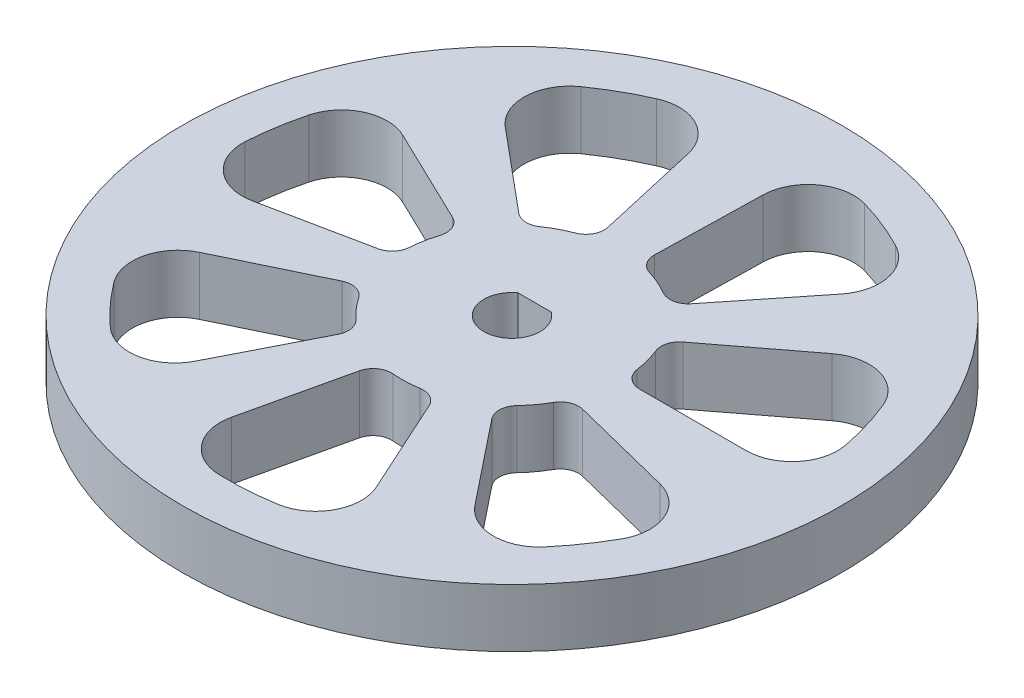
from build123d import *

# Parameters (mm, degrees)
SKETCH1_R      = 36
EXTRUDE1_DEPTH = 6.35


with BuildPart() as part:
    # Sketch1 → Extrude1 (new body)
    with BuildSketch(Plane(origin=(0, 0, 0), x_dir=(1, 0, 0), z_dir=(0, 1, 0))):
        with Locations(Location((0, 0, 0), (0, 0, 270))):
            Circle(SKETCH1_R)
        with BuildLine():
            Line((8.683422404, -10.88866729), (15.952628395, -20.003963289))
            ThreePointArc((15.952628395, -20.003963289), (19.783257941, -21.885897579), (23.671104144, -20.12520133))
            ThreePointArc((23.671104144, -20.12520133), (25.527775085, -17.710945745), (27.139153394, -15.12650829))
            ThreePointArc((27.139153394, -15.12650829), (27.361274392, -10.708283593), (23.990693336, -7.84310811))
            Line((23.990693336, -7.84310811), (12.721300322, -5.010243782))
            ThreePointArc((12.721300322, -5.010243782), (11.447614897, -5.110865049), (10.494737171, -5.961995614))
            ThreePointArc((10.494737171, -5.961995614), (9.711495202, -7.16740964), (8.790498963, -8.271156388))
            ThreePointArc((8.790498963, -8.271156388), (8.248756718, -9.559940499), (8.683422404, -10.88866729))
        make_face(mode=Mode.SUBTRACT)
        with BuildLine():
            Line((13.927128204, 0), (25.586029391, 0))
            ThreePointArc((25.586029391, 0), (29.445743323, 1.821539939), (30.493208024, 5.958956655))
            ThreePointArc((30.493208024, 5.958956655), (29.763282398, 8.915824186), (28.747365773, 11.787020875))
            ThreePointArc((28.747365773, 11.787020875), (25.431548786, 14.715400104), (21.089941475, 13.866581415))
            Line((21.089941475, 13.866581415), (11.84876734, 6.822077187))
            ThreePointArc((11.84876734, 6.822077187), (11.133306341, 5.763533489), (11.204637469, 4.487872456))
            ThreePointArc((11.204637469, 4.487872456), (11.658724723, 3.123945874), (11.947436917, 1.715707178))
            ThreePointArc((11.947436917, 1.715707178), (12.617278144, 0.488612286), (13.927128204, 0))
        make_face(mode=Mode.SUBTRACT)
        with BuildLine():
            Line((1.831876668, 2.46356), (-1.831876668, 2.46356))
            ThreePointArc((-1.831876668, 2.46356), (0, -3.07), (1.831876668, 2.46356))
        make_face(mode=Mode.SUBTRACT)
        with BuildLine():
            Line((-3.099077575, -13.577946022), (-5.693427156, -24.944534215))
            ThreePointArc((-5.693427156, -24.944534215), (-4.776424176, -29.112807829), (-0.975823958, -31.054672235))
            ThreePointArc((-0.975823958, -31.054672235), (2.069332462, -31.001012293), (5.094604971, -30.649468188))
            ThreePointArc((5.094604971, -30.649468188), (8.687402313, -28.068411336), (8.825963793, -23.646777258))
            Line((8.825963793, -23.646777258), (4.014434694, -13.069748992))
            ThreePointArc((4.014434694, -13.069748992), (3.141635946, -12.136677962), (1.88208573, -11.922359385))
            ThreePointArc((1.88208573, -11.922359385), (0.451311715, -12.061559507), (-0.985864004, -12.029670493))
            ThreePointArc((-0.985864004, -12.029670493), (-2.331246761, -12.409663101), (-3.099077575, -13.577946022))
        make_face(mode=Mode.SUBTRACT)
        with BuildLine():
            Line((-12.547908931, -6.04275446), (-23.052215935, -11.101362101))
            ThreePointArc((-23.052215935, -11.101362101), (-25.739361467, -14.41717999), (-24.887936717, -18.599341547))
            ThreePointArc((-24.887936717, -18.599341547), (-22.947359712, -20.946684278), (-20.786284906, -23.092753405))
            ThreePointArc((-20.786284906, -23.092753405), (-16.528260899, -24.292452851), (-12.984896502, -21.643940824))
            Line((-12.984896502, -21.643940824), (-7.715382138, -11.287466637))
            ThreePointArc((-7.715382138, -11.287466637), (-7.53005895, -10.023324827), (-8.147814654, -8.904943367))
            ThreePointArc((-8.147814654, -8.904943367), (-9.148718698, -7.873109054), (-10.019851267, -6.729597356))
            ThreePointArc((-10.019851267, -6.729597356), (-11.15577388, -5.914656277), (-12.547908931, -6.04275446))
        make_face(mode=Mode.SUBTRACT)
        with BuildLine():
            Line((-12.547908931, 6.04275446), (-23.052215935, 11.101362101))
            ThreePointArc((-23.052215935, 11.101362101), (-27.320034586, 11.134878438), (-30.058925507, 7.861672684))
            ThreePointArc((-30.058925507, 7.861672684), (-30.684221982, 4.880924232), (-31.014678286, 1.853275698))
            ThreePointArc((-31.014678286, 1.853275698), (-29.297806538, -2.223781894), (-25.017864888, -3.342775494))
            Line((-25.017864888, -3.342775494), (-13.635358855, -1.005491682))
            ThreePointArc((-13.635358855, -1.005491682), (-12.531465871, -0.362203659), (-12.042244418, 0.818076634))
            ThreePointArc((-12.042244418, 0.818076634), (-11.859577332, 2.243953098), (-11.508686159, 3.637999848))
            ThreePointArc((-11.508686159, 3.637999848), (-11.579775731, 5.03420736), (-12.547908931, 6.04275446))
        make_face(mode=Mode.SUBTRACT)
        with BuildLine():
            Line((-3.099077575, 13.577946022), (-5.693427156, 24.944534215))
            ThreePointArc((-5.693427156, 24.944534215), (-8.328164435, 28.302146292), (-12.594930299, 28.402687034))
            ThreePointArc((-12.594930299, 28.402687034), (-15.315239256, 27.033097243), (-17.888386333, 25.4037504))
            ThreePointArc((-17.888386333, 25.4037504), (-20.005506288, 21.519442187), (-18.211870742, 17.475567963))
            Line((-18.211870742, 17.475567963), (-9.287632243, 10.033639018))
            ThreePointArc((-9.287632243, 10.033639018), (-8.096423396, 9.571664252), (-6.868618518, 9.925068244))
            ThreePointArc((-6.868618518, 9.925068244), (-5.639932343, 10.6712728), (-4.331245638, 11.266108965))
            ThreePointArc((-4.331245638, 11.266108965), (-3.283970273, 12.192210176), (-3.099077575, 13.577946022))
        make_face(mode=Mode.SUBTRACT)
        with BuildLine():
            Line((8.683422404, 10.88866729), (15.952628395, 20.003963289))
            ThreePointArc((15.952628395, 20.003963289), (16.9349834, 24.15732073), (14.353304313, 27.555898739))
            ThreePointArc((14.353304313, 27.555898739), (11.586431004, 28.828796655), (8.708225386, 29.824682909))
            ThreePointArc((8.708225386, 29.824682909), (4.351348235, 29.058087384), (2.308033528, 25.134452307))
            Line((2.308033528, 25.134452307), (2.053870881, 13.517234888))
            ThreePointArc((2.053870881, 13.517234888), (2.435391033, 12.297873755), (3.47721722, 11.558281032))
            ThreePointArc((3.47721722, 11.558281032), (4.826696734, 11.062906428), (6.107711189, 10.410608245))
            ThreePointArc((6.107711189, 10.410608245), (7.484731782, 10.169230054), (8.683422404, 10.88866729))
        make_face(mode=Mode.SUBTRACT)
    extrude(amount=EXTRUDE1_DEPTH)


solid = part.part
